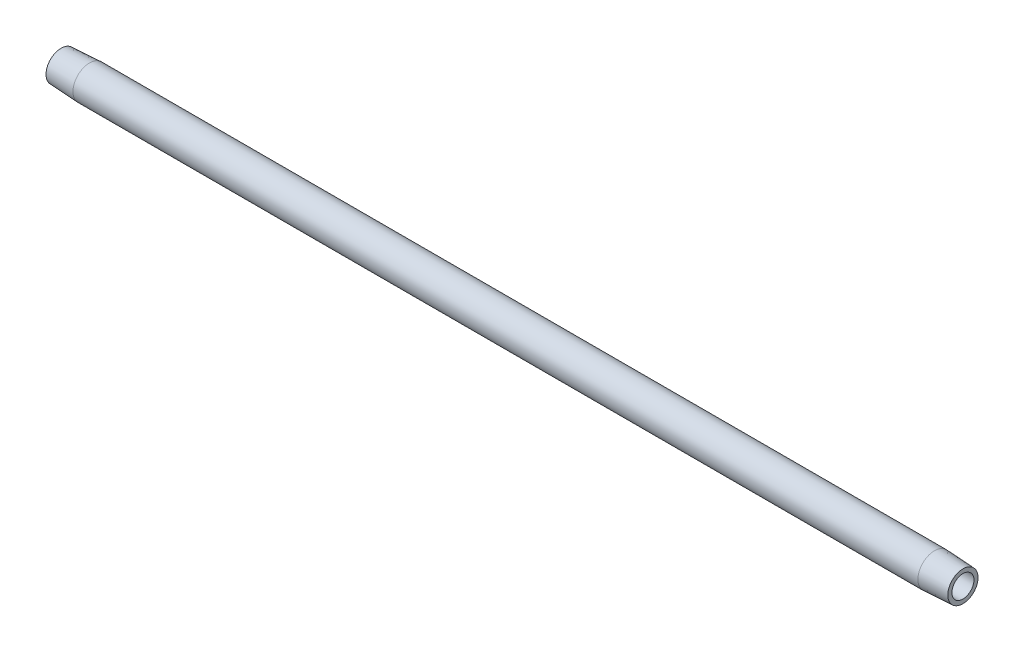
ISO-10303-21;
HEADER;
FILE_DESCRIPTION(('STEP AP214'),'2;1');
FILE_NAME('part.step','',(''),(''),'','','');
FILE_SCHEMA(('AUTOMOTIVE_DESIGN { 1 0 10303 214 1 1 1 1 }'));
ENDSEC;
DATA;
#1=APPLICATION_CONTEXT('core data for automotive mechanical design processes');
#2=APPLICATION_PROTOCOL_DEFINITION('international standard','automotive_design',2000,#1);
#3=PRODUCT_CONTEXT('',#1,'mechanical');
#4=PRODUCT('Part','Part','',(#3));
#5=PRODUCT_RELATED_PRODUCT_CATEGORY('part','',(#4));
#6=PRODUCT_DEFINITION_FORMATION('','',#4);
#7=PRODUCT_DEFINITION_CONTEXT('part definition',#1,'design');
#8=PRODUCT_DEFINITION('design','',#6,#7);
#9=PRODUCT_DEFINITION_SHAPE('','',#8);
#10=(LENGTH_UNIT() NAMED_UNIT(*) SI_UNIT(.MILLI.,.METRE.));
#11=(NAMED_UNIT(*) PLANE_ANGLE_UNIT() SI_UNIT($,.RADIAN.));
#12=(NAMED_UNIT(*) SI_UNIT($,.STERADIAN.) SOLID_ANGLE_UNIT());
#13=UNCERTAINTY_MEASURE_WITH_UNIT(LENGTH_MEASURE(1.E-05),#10,'distance_accuracy_value','');
#14=(GEOMETRIC_REPRESENTATION_CONTEXT(3) GLOBAL_UNCERTAINTY_ASSIGNED_CONTEXT((#13)) GLOBAL_UNIT_ASSIGNED_CONTEXT((#10,
#11,#12)) REPRESENTATION_CONTEXT('',''));
#15=CARTESIAN_POINT('',(0.,0.,0.));
#16=DIRECTION('',(0.,0.,1.));
#17=DIRECTION('',(1.,0.,0.));
#18=AXIS2_PLACEMENT_3D('',#15,#16,#17);
#19=CARTESIAN_POINT('',(0.476141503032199,0.,0.));
#20=DIRECTION('',(-1.,0.,0.));
#21=DIRECTION('',(0.,0.,1.));
#22=AXIS2_PLACEMENT_3D('',#19,#20,#21);
#23=CYLINDRICAL_SURFACE('',#22,5.14349999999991);
#24=CARTESIAN_POINT('',(8.8100393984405,0.,0.));
#25=DIRECTION('',(-1.,0.,0.));
#26=DIRECTION('',(0.,0.,1.));
#27=AXIS2_PLACEMENT_3D('',#24,#25,#26);
#28=CIRCLE('',#27,5.14349999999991);
#29=CARTESIAN_POINT('',(8.8100393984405,0.,5.14349999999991));
#30=VERTEX_POINT('',#29);
#31=EDGE_CURVE('E10',#30,#30,#28,.T.);
#32=ORIENTED_EDGE('',*,*,#31,.F.);
#33=EDGE_LOOP('',(#32));
#34=FACE_BOUND('',#33,.T.);
#35=CARTESIAN_POINT('',(270.589960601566,0.,0.));
#36=DIRECTION('',(-1.,0.,0.));
#37=DIRECTION('',(0.,0.,1.));
#38=AXIS2_PLACEMENT_3D('',#35,#36,#37);
#39=CIRCLE('',#38,5.14349999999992);
#40=CARTESIAN_POINT('',(270.589960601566,0.,5.14349999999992));
#41=VERTEX_POINT('',#40);
#42=EDGE_CURVE('E52',#41,#41,#39,.T.);
#43=ORIENTED_EDGE('',*,*,#42,.T.);
#44=EDGE_LOOP('',(#43));
#45=FACE_BOUND('',#44,.T.);
#46=ADVANCED_FACE('F30',(#34,#45),#23,.T.);
#47=CARTESIAN_POINT('',(8.8100393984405,0.,0.));
#48=DIRECTION('',(1.,0.,0.));
#49=DIRECTION('',(0.,0.,-1.));
#50=AXIS2_PLACEMENT_3D('',#47,#48,#49);
#51=CONICAL_SURFACE('',#50,5.14349999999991,0.0523598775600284);
#52=CARTESIAN_POINT('',(0.,0.,0.));
#53=DIRECTION('',(-1.,0.,0.));
#54=DIRECTION('',(0.,0.,1.));
#55=AXIS2_PLACEMENT_3D('',#52,#53,#54);
#56=CIRCLE('',#55,4.68178539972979);
#57=CARTESIAN_POINT('',(0.,0.,4.68178539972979));
#58=VERTEX_POINT('',#57);
#59=EDGE_CURVE('E36',#58,#58,#56,.T.);
#60=ORIENTED_EDGE('',*,*,#59,.F.);
#61=EDGE_LOOP('',(#60));
#62=FACE_BOUND('',#61,.T.);
#63=ORIENTED_EDGE('',*,*,#31,.T.);
#64=EDGE_LOOP('',(#63));
#65=FACE_BOUND('',#64,.T.);
#66=ADVANCED_FACE('F77',(#62,#65),#51,.T.);
#67=CARTESIAN_POINT('',(0.,4.68178539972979,0.));
#68=DIRECTION('',(1.,0.,0.));
#69=DIRECTION('',(0.,0.,-1.));
#70=AXIS2_PLACEMENT_3D('',#67,#68,#69);
#71=PLANE('',#70);
#72=CARTESIAN_POINT('',(0.,0.,0.));
#73=DIRECTION('',(-1.,0.,0.));
#74=DIRECTION('',(0.,0.,1.));
#75=AXIS2_PLACEMENT_3D('',#72,#73,#74);
#76=CIRCLE('',#75,3.4163);
#77=CARTESIAN_POINT('',(0.,0.,3.4163));
#78=VERTEX_POINT('',#77);
#79=EDGE_CURVE('E40',#78,#78,#76,.T.);
#80=ORIENTED_EDGE('',*,*,#79,.F.);
#81=EDGE_LOOP('',(#80));
#82=FACE_BOUND('',#81,.T.);
#83=ORIENTED_EDGE('',*,*,#59,.T.);
#84=EDGE_LOOP('',(#83));
#85=FACE_BOUND('',#84,.T.);
#86=ADVANCED_FACE('F72',(#82,#85),#71,.F.);
#87=CARTESIAN_POINT('',(0.476141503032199,0.,0.));
#88=DIRECTION('',(-1.,0.,0.));
#89=DIRECTION('',(0.,0.,1.));
#90=AXIS2_PLACEMENT_3D('',#87,#88,#89);
#91=CYLINDRICAL_SURFACE('',#90,3.4163);
#92=CARTESIAN_POINT('',(279.4,0.,0.));
#93=DIRECTION('',(-1.,0.,0.));
#94=DIRECTION('',(0.,0.,1.));
#95=AXIS2_PLACEMENT_3D('',#92,#93,#94);
#96=CIRCLE('',#95,3.41630000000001);
#97=CARTESIAN_POINT('',(279.4,0.,3.41630000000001));
#98=VERTEX_POINT('',#97);
#99=EDGE_CURVE('E44',#98,#98,#96,.T.);
#100=ORIENTED_EDGE('',*,*,#99,.F.);
#101=EDGE_LOOP('',(#100));
#102=FACE_BOUND('',#101,.T.);
#103=ORIENTED_EDGE('',*,*,#79,.T.);
#104=EDGE_LOOP('',(#103));
#105=FACE_BOUND('',#104,.T.);
#106=ADVANCED_FACE('F66',(#102,#105),#91,.F.);
#107=CARTESIAN_POINT('',(279.4,3.41630000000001,0.));
#108=DIRECTION('',(-1.,0.,0.));
#109=DIRECTION('',(0.,0.,1.));
#110=AXIS2_PLACEMENT_3D('',#107,#108,#109);
#111=PLANE('',#110);
#112=CARTESIAN_POINT('',(279.4,0.,0.));
#113=DIRECTION('',(-1.,0.,0.));
#114=DIRECTION('',(0.,0.,1.));
#115=AXIS2_PLACEMENT_3D('',#112,#113,#114);
#116=CIRCLE('',#115,4.68178539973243);
#117=CARTESIAN_POINT('',(279.4,0.,4.68178539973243));
#118=VERTEX_POINT('',#117);
#119=EDGE_CURVE('E49',#118,#118,#116,.T.);
#120=ORIENTED_EDGE('',*,*,#119,.F.);
#121=EDGE_LOOP('',(#120));
#122=FACE_BOUND('',#121,.T.);
#123=ORIENTED_EDGE('',*,*,#99,.T.);
#124=EDGE_LOOP('',(#123));
#125=FACE_BOUND('',#124,.T.);
#126=ADVANCED_FACE('F60',(#122,#125),#111,.F.);
#127=CARTESIAN_POINT('',(279.4,0.,0.));
#128=DIRECTION('',(-1.,0.,0.));
#129=DIRECTION('',(0.,0.,1.));
#130=AXIS2_PLACEMENT_3D('',#127,#128,#129);
#131=CONICAL_SURFACE('',#130,4.68178539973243,0.0523598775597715);
#132=ORIENTED_EDGE('',*,*,#42,.F.);
#133=EDGE_LOOP('',(#132));
#134=FACE_BOUND('',#133,.T.);
#135=ORIENTED_EDGE('',*,*,#119,.T.);
#136=EDGE_LOOP('',(#135));
#137=FACE_BOUND('',#136,.T.);
#138=ADVANCED_FACE('F57',(#134,#137),#131,.T.);
#139=CLOSED_SHELL('',(#46,#66,#86,#106,#126,#138));
#140=MANIFOLD_SOLID_BREP('B2',#139);
#141=ADVANCED_BREP_SHAPE_REPRESENTATION('',(#18,#140),#14);
#142=SHAPE_DEFINITION_REPRESENTATION(#9,#141);
ENDSEC;
END-ISO-10303-21;
